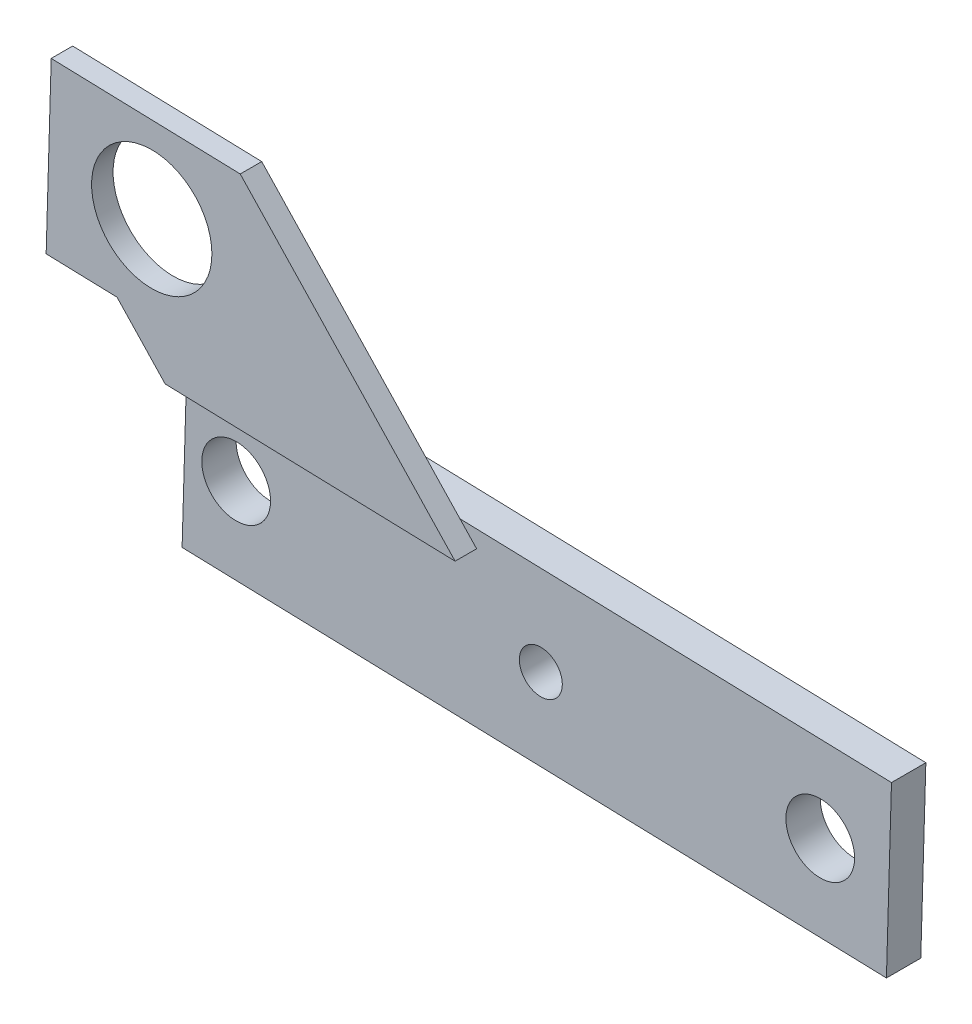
from build123d import *

# Parameters (mm, degrees)
ESQUISSE1_R          = 2
ESQUISSE1_R_2        = 1.25
BASE_EXTRUSION_DEPTH = 2
BOSS_EXTRU_1_START   = 2.45
ESQUISSE2_R          = 2.5
ESQUISSE2_R_2        = 1.25
BOSS_EXTRU_1_DEPTH   = 2.45
ESQUISSE3_R          = 3.5
BOSS_EXTRU_2_DEPTH   = 1.25


with BuildPart() as part:
    # Esquisse1 → Base-Extrusion (new body)
    with BuildSketch(Plane.XY):
        Polygon((41.792257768, -8.119810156), (0.809995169, -6.913927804), (0.515877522, -16.909601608), (41.498140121, -18.115483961), align=None)
        with Locations((37.646929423, -13)):
            Circle(ESQUISSE1_R, mode=Mode.SUBTRACT)
        with Locations(Location((21.389211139, -12.75, 0), (0, 0, 179.4))):
            Circle(ESQUISSE1_R_2, mode=Mode.SUBTRACT)
        with Locations((3.661638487, -12)):
            Circle(ESQUISSE1_R, mode=Mode.SUBTRACT)
    extrude(amount=BASE_EXTRUSION_DEPTH)

    # Esquisse2 → Boss.-Extru.1 (add)
    with BuildSketch(Plane(origin=(0, 0, 0), x_dir=(-1, 0, 0), z_dir=(0, 0, -1)).offset(BOSS_EXTRU_1_START)):
        with Locations((-21.389211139, -12.75)):
            Circle(ESQUISSE2_R)
        with Locations(Location((-21.389211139, -12.75, 0), (0, 0, 0.6))):
            Circle(ESQUISSE2_R_2, mode=Mode.SUBTRACT)
    extrude(amount=-BOSS_EXTRU_1_DEPTH)

    # Esquisse3 → Boss.-Extru.2 (add)
    with BuildSketch(Plane.XY.offset(2)):
        Polygon((-5.850345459, 5.174307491), (5.149654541, 4.850638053), (17.652159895, -8.409932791), (0.780583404, -7.913495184), (-2.020365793, -4.942715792), (-6.144463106, -4.821366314), align=None)
        Circle(ESQUISSE3_R, mode=Mode.SUBTRACT)
    extrude(amount=BOSS_EXTRU_2_DEPTH)


solid = part.part
